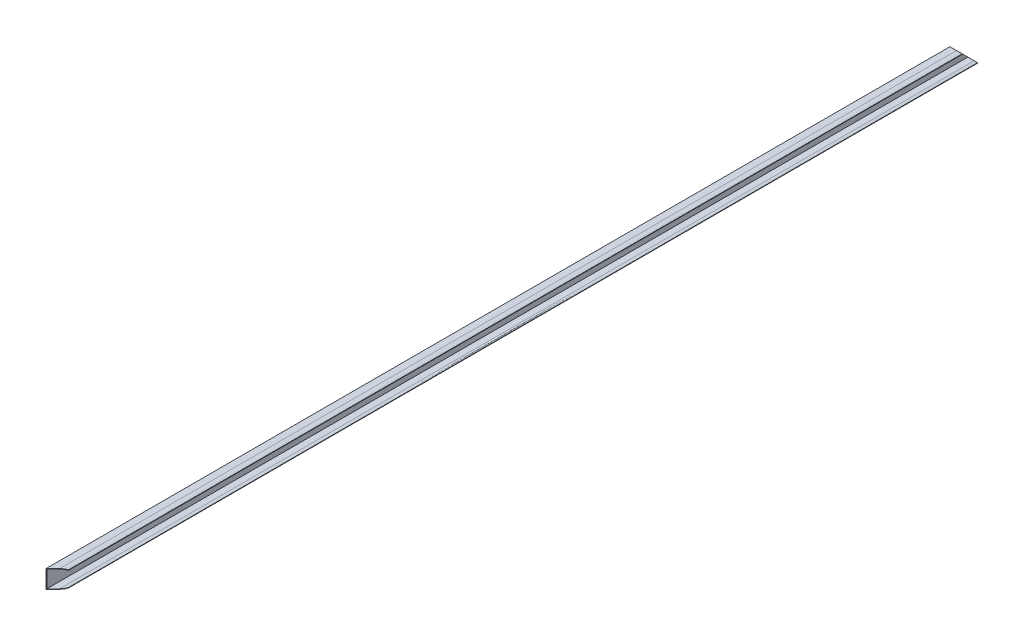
ISO-10303-21;
HEADER;
FILE_DESCRIPTION(('STEP AP214'),'2;1');
FILE_NAME('part.step','',(''),(''),'','','');
FILE_SCHEMA(('AUTOMOTIVE_DESIGN { 1 0 10303 214 1 1 1 1 }'));
ENDSEC;
DATA;
#1=APPLICATION_CONTEXT('core data for automotive mechanical design processes');
#2=APPLICATION_PROTOCOL_DEFINITION('international standard','automotive_design',2000,#1);
#3=PRODUCT_CONTEXT('',#1,'mechanical');
#4=PRODUCT('Part','Part','',(#3));
#5=PRODUCT_RELATED_PRODUCT_CATEGORY('part','',(#4));
#6=PRODUCT_DEFINITION_FORMATION('','',#4);
#7=PRODUCT_DEFINITION_CONTEXT('part definition',#1,'design');
#8=PRODUCT_DEFINITION('design','',#6,#7);
#9=PRODUCT_DEFINITION_SHAPE('','',#8);
#10=(LENGTH_UNIT() NAMED_UNIT(*) SI_UNIT(.MILLI.,.METRE.));
#11=(NAMED_UNIT(*) PLANE_ANGLE_UNIT() SI_UNIT($,.RADIAN.));
#12=(NAMED_UNIT(*) SI_UNIT($,.STERADIAN.) SOLID_ANGLE_UNIT());
#13=UNCERTAINTY_MEASURE_WITH_UNIT(LENGTH_MEASURE(1.E-05),#10,'distance_accuracy_value','');
#14=(GEOMETRIC_REPRESENTATION_CONTEXT(3) GLOBAL_UNCERTAINTY_ASSIGNED_CONTEXT((#13)) GLOBAL_UNIT_ASSIGNED_CONTEXT((#10,
#11,#12)) REPRESENTATION_CONTEXT('',''));
#15=CARTESIAN_POINT('',(0.,0.,0.));
#16=DIRECTION('',(0.,0.,1.));
#17=DIRECTION('',(1.,0.,0.));
#18=AXIS2_PLACEMENT_3D('',#15,#16,#17);
#19=CARTESIAN_POINT('',(0.,0.,4100.));
#20=DIRECTION('',(0.,1.,0.));
#21=DIRECTION('',(0.,0.,1.));
#22=AXIS2_PLACEMENT_3D('',#19,#20,#21);
#23=PLANE('',#22);
#24=DIRECTION('',(0.,0.,-1.));
#25=VECTOR('',#24,1.);
#26=CARTESIAN_POINT('',(30.,0.,4100.));
#27=LINE('',#26,#25);
#28=CARTESIAN_POINT('',(30.,0.,4070.));
#29=VERTEX_POINT('',#28);
#30=CARTESIAN_POINT('',(30.,0.,0.));
#31=VERTEX_POINT('',#30);
#32=EDGE_CURVE('E11',#29,#31,#27,.T.);
#33=ORIENTED_EDGE('',*,*,#32,.F.);
#34=DIRECTION('',(0.707106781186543,0.,-0.707106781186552));
#35=VECTOR('',#34,1.);
#36=CARTESIAN_POINT('',(0.,0.,4100.));
#37=LINE('',#36,#35);
#38=CARTESIAN_POINT('',(0.,0.,4100.));
#39=VERTEX_POINT('',#38);
#40=EDGE_CURVE('E194',#39,#29,#37,.T.);
#41=ORIENTED_EDGE('',*,*,#40,.F.);
#42=DIRECTION('',(0.,0.,-1.));
#43=VECTOR('',#42,1.);
#44=CARTESIAN_POINT('',(0.,0.,4100.));
#45=LINE('',#44,#43);
#46=CARTESIAN_POINT('',(0.,0.,0.));
#47=VERTEX_POINT('',#46);
#48=EDGE_CURVE('E371',#39,#47,#45,.T.);
#49=ORIENTED_EDGE('',*,*,#48,.T.);
#50=DIRECTION('',(1.,0.,0.));
#51=VECTOR('',#50,1.);
#52=CARTESIAN_POINT('',(0.,0.,0.));
#53=LINE('',#52,#51);
#54=EDGE_CURVE('E270',#47,#31,#53,.T.);
#55=ORIENTED_EDGE('',*,*,#54,.T.);
#56=EDGE_LOOP('',(#33,#41,#49,#55));
#57=FACE_BOUND('',#56,.T.);
#58=ADVANCED_FACE('F32',(#57),#23,.F.);
#59=CARTESIAN_POINT('',(30.,0.,4100.));
#60=CARTESIAN_POINT('',(40.6032812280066,0.0484567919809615,4100.));
#61=CARTESIAN_POINT('',(50.,5.,4100.));
#62=B_SPLINE_CURVE_WITH_KNOTS('',2,(#59,#60,#61),.UNSPECIFIED.,.F.,.F.,(3,3),(0.,1.),.UNSPECIFIED.);
#63=DIRECTION('',(0.,0.,-1.));
#64=VECTOR('',#63,1.);
#65=SURFACE_OF_LINEAR_EXTRUSION('',#62,#64);
#66=ORIENTED_EDGE('',*,*,#32,.T.);
#67=CARTESIAN_POINT('',(50.,5.,4.99999999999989));
#68=CARTESIAN_POINT('',(49.5210550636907,4.74761460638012,4.74761460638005));
#69=CARTESIAN_POINT('',(49.0347280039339,4.50214773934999,4.50214773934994));
#70=CARTESIAN_POINT('',(48.0467010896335,4.02606279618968,4.02606279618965));
#71=CARTESIAN_POINT('',(47.5449794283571,3.79546736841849,3.79546736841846));
#72=CARTESIAN_POINT('',(46.5267291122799,3.35078644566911,3.35078644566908));
#73=CARTESIAN_POINT('',(46.0101932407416,3.13670919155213,3.13670919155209));
#74=CARTESIAN_POINT('',(44.9634416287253,2.7267907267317,2.7267907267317));
#75=CARTESIAN_POINT('',(44.4332389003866,2.530932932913,2.53093293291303));
#76=CARTESIAN_POINT('',(43.3596325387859,2.1587101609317,2.15871016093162));
#77=CARTESIAN_POINT('',(42.8162357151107,1.9823353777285,1.98233537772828));
#78=CARTESIAN_POINT('',(41.7171702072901,1.65035131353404,1.65035131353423));
#79=CARTESIAN_POINT('',(41.1615076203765,1.49473197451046,1.49473197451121));
#80=CARTESIAN_POINT('',(40.1825845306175,1.2423713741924,1.24237137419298));
#81=CARTESIAN_POINT('',(39.7618260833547,1.14075340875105,1.1407534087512));
#82=CARTESIAN_POINT('',(38.9146879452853,0.950024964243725,0.950024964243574));
#83=CARTESIAN_POINT('',(38.4883085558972,0.860913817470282,0.860913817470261));
#84=CARTESIAN_POINT('',(37.6310401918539,0.695625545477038,0.695625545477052));
#85=CARTESIAN_POINT('',(37.2001563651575,0.619435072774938,0.619435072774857));
#86=CARTESIAN_POINT('',(36.3341748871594,0.480132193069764,0.480132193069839));
#87=CARTESIAN_POINT('',(35.8990771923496,0.41701992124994,0.417019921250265));
#88=CARTESIAN_POINT('',(35.0123765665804,0.302350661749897,0.302350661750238));
#89=CARTESIAN_POINT('',(34.5606694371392,0.251196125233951,0.251196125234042));
#90=CARTESIAN_POINT('',(33.6544975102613,0.16301119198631,0.16301119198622));
#91=CARTESIAN_POINT('',(33.2000326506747,0.125981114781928,0.125981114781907));
#92=CARTESIAN_POINT('',(32.2884626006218,0.0659644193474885,0.0659644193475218));
#93=CARTESIAN_POINT('',(31.831354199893,0.0430022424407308,0.0430022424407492));
#94=CARTESIAN_POINT('',(30.9161801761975,0.0110581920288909,0.0110581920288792));
#95=CARTESIAN_POINT('',(30.4581145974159,0.00207568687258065,0.00207568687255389));
#96=CARTESIAN_POINT('',(30.,0.,0.));
#97=B_SPLINE_CURVE_WITH_KNOTS('',3,(#67,#68,#69,#70,#71,#72,#73,#74,#75,#76,#77,#78,#79,#80,#81,
#82,#83,#84,#85,#86,#87,#88,#89,#90,#91,#92,#93,#94,#95,#96),.UNSPECIFIED.,.F.,.F.,(4,2,2,2,2,2,
2,2,2,2,2,2,2,2,4),(0.,1.79192712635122,3.58652177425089,5.38200602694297,7.17583972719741,
8.96876650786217,10.7608212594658,12.0943329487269,13.4277734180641,14.759827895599,
16.0918961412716,17.4638388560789,18.8358126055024,20.2101632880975,21.5844518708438),.UNSPECIFIED.);
#98=CARTESIAN_POINT('',(50.,4.99999999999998,4.99999999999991));
#99=VERTEX_POINT('',#98);
#100=EDGE_CURVE('E305',#99,#31,#97,.T.);
#101=ORIENTED_EDGE('',*,*,#100,.F.);
#102=DIRECTION('',(0.,0.,-1.));
#103=VECTOR('',#102,1.);
#104=CARTESIAN_POINT('',(50.,5.,4100.));
#105=LINE('',#104,#103);
#106=CARTESIAN_POINT('',(50.,5.,4050.));
#107=VERTEX_POINT('',#106);
#108=EDGE_CURVE('E46',#107,#99,#105,.T.);
#109=ORIENTED_EDGE('',*,*,#108,.F.);
#110=CARTESIAN_POINT('',(30.,0.,4070.));
#111=CARTESIAN_POINT('',(30.6272946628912,0.00285611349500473,4069.37270533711));
#112=CARTESIAN_POINT('',(31.2545746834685,0.0186179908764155,4068.74542531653));
#113=CARTESIAN_POINT('',(32.5085722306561,0.076653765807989,4067.49142776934));
#114=CARTESIAN_POINT('',(33.1352897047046,0.118929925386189,4066.8647102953));
#115=CARTESIAN_POINT('',(34.3876637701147,0.230707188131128,4065.61233622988));
#116=CARTESIAN_POINT('',(35.0133200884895,0.300214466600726,4064.98667991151));
#117=CARTESIAN_POINT('',(36.2627376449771,0.467046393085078,4063.73726235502));
#118=CARTESIAN_POINT('',(36.8864989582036,0.564369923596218,4063.1135010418));
#119=CARTESIAN_POINT('',(38.5675300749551,0.865472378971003,4061.43246992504));
#120=CARTESIAN_POINT('',(39.6224623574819,1.09607135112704,4060.37753764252));
#121=CARTESIAN_POINT('',(41.7212568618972,1.64106978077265,4058.2787431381));
#122=CARTESIAN_POINT('',(42.7651214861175,1.9554506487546,4057.23487851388));
#123=CARTESIAN_POINT('',(44.326772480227,2.49275963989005,4055.67322751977));
#124=CARTESIAN_POINT('',(44.8500436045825,2.68429385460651,4055.14995639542));
#125=CARTESIAN_POINT('',(45.8923921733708,3.08904722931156,4054.10760782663));
#126=CARTESIAN_POINT('',(46.4114696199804,3.30226637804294,4053.58853038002));
#127=CARTESIAN_POINT('',(47.4451599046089,3.75040246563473,4052.55484009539));
#128=CARTESIAN_POINT('',(47.9597707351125,3.98532865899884,4052.04022926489));
#129=CARTESIAN_POINT('',(48.9838539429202,4.47662567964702,4051.01614605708));
#130=CARTESIAN_POINT('',(49.4933262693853,4.73299671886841,4050.50667373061));
#131=CARTESIAN_POINT('',(50.,5.,4050.));
#132=B_SPLINE_CURVE_WITH_KNOTS('',3,(#110,#111,#112,#113,#114,#115,#116,#117,#118,#119,#120,
#121,#122,#123,#124,#125,#126,#127,#128,#129,#130,#131),.UNSPECIFIED.,.F.,.F.,(4,2,2,2,2,2,2,2,
2,2,4),(0.,2.66133520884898,5.32289749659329,7.9850637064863,10.6471229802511,15.1735338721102,
19.6989412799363,21.9918706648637,24.2847988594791,26.5787091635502,28.8726421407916),.UNSPECIFIED.);
#133=EDGE_CURVE('E184',#29,#107,#132,.T.);
#134=ORIENTED_EDGE('',*,*,#133,.F.);
#135=EDGE_LOOP('',(#66,#101,#109,#134));
#136=FACE_BOUND('',#135,.T.);
#137=ADVANCED_FACE('F419',(#136),#65,.F.);
#138=CARTESIAN_POINT('',(50.,5.,4100.));
#139=DIRECTION('',(-1.,0.,0.));
#140=DIRECTION('',(0.,0.,1.));
#141=AXIS2_PLACEMENT_3D('',#138,#139,#140);
#142=PLANE('',#141);
#143=ORIENTED_EDGE('',*,*,#108,.T.);
#144=DIRECTION('',(0.,-0.707106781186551,-0.707106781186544));
#145=VECTOR('',#144,1.);
#146=CARTESIAN_POINT('',(50.,80.,79.9999999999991));
#147=LINE('',#146,#145);
#148=CARTESIAN_POINT('',(50.,7.00000000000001,6.99999999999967));
#149=VERTEX_POINT('',#148);
#150=EDGE_CURVE('E292',#149,#99,#147,.T.);
#151=ORIENTED_EDGE('',*,*,#150,.F.);
#152=DIRECTION('',(0.,0.,-1.));
#153=VECTOR('',#152,1.);
#154=CARTESIAN_POINT('',(50.,7.00000000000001,4100.));
#155=LINE('',#154,#153);
#156=CARTESIAN_POINT('',(50.,7.00000000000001,4050.));
#157=VERTEX_POINT('',#156);
#158=EDGE_CURVE('E173',#157,#149,#155,.T.);
#159=ORIENTED_EDGE('',*,*,#158,.F.);
#160=DIRECTION('',(0.,1.,0.));
#161=VECTOR('',#160,1.);
#162=CARTESIAN_POINT('',(50.,-0.001000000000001,4050.));
#163=LINE('',#162,#161);
#164=EDGE_CURVE('E247',#107,#157,#163,.T.);
#165=ORIENTED_EDGE('',*,*,#164,.F.);
#166=EDGE_LOOP('',(#143,#151,#159,#165));
#167=FACE_BOUND('',#166,.T.);
#168=ADVANCED_FACE('F405',(#167),#142,.F.);
#169=CARTESIAN_POINT('',(50.,7.00000000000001,4100.));
#170=CARTESIAN_POINT('',(40.6032812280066,2.04845679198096,4100.));
#171=CARTESIAN_POINT('',(30.,2.,4100.));
#172=B_SPLINE_CURVE_WITH_KNOTS('',2,(#169,#170,#171),.UNSPECIFIED.,.F.,.F.,(3,3),(0.,1.),.UNSPECIFIED.);
#173=DIRECTION('',(0.,0.,-1.));
#174=VECTOR('',#173,1.);
#175=SURFACE_OF_LINEAR_EXTRUSION('',#172,#174);
#176=ORIENTED_EDGE('',*,*,#158,.T.);
#177=CARTESIAN_POINT('',(30.,2.,1.99999999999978));
#178=CARTESIAN_POINT('',(30.2965221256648,2.00135208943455,2.00135208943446));
#179=CARTESIAN_POINT('',(30.5930205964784,2.00558904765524,2.00558904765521));
#180=CARTESIAN_POINT('',(31.1856963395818,2.01988890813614,2.01988890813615));
#181=CARTESIAN_POINT('',(31.4818736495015,2.02995103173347,2.02995103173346));
#182=CARTESIAN_POINT('',(32.0736889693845,2.05595672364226,2.05595672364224));
#183=CARTESIAN_POINT('',(32.3693270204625,2.07189982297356,2.07189982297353));
#184=CARTESIAN_POINT('',(32.9597359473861,2.10969490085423,2.10969490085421));
#185=CARTESIAN_POINT('',(33.2545071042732,2.13154468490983,2.13154468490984));
#186=CARTESIAN_POINT('',(33.8430758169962,2.18117540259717,2.1811754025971));
#187=CARTESIAN_POINT('',(34.1368732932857,2.20895680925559,2.2089568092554));
#188=CARTESIAN_POINT('',(34.7232698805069,2.27044981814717,2.27044981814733));
#189=CARTESIAN_POINT('',(35.0158687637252,2.30416249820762,2.30416249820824));
#190=CARTESIAN_POINT('',(35.8889009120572,2.41384806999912,2.41384807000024));
#191=CARTESIAN_POINT('',(36.467182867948,2.49858893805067,2.49858893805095));
#192=CARTESIAN_POINT('',(37.6162181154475,2.69114757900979,2.69114757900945));
#193=CARTESIAN_POINT('',(38.1869682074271,2.79897484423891,2.79897484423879));
#194=CARTESIAN_POINT('',(39.3191210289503,3.0370161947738,3.03701619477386));
#195=CARTESIAN_POINT('',(39.8805226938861,3.16723281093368,3.16723281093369));
#196=CARTESIAN_POINT('',(40.9934871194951,3.44938335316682,3.44938335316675));
#197=CARTESIAN_POINT('',(41.5450291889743,3.60135801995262,3.60135801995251));
#198=CARTESIAN_POINT('',(42.6358830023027,3.92568946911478,3.92568946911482));
#199=CARTESIAN_POINT('',(43.1751963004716,4.09804364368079,4.09804364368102));
#200=CARTESIAN_POINT('',(44.2406108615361,4.46185600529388,4.46185600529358));
#201=CARTESIAN_POINT('',(44.7667154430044,4.65330933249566,4.65330933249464));
#202=CARTESIAN_POINT('',(45.5602041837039,4.95948974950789,4.95948974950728));
#203=CARTESIAN_POINT('',(45.8325761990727,5.06781364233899,5.06781364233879));
#204=CARTESIAN_POINT('',(46.3733730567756,5.28921123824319,5.28921123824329));
#205=CARTESIAN_POINT('',(46.6417986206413,5.40228405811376,5.40228405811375));
#206=CARTESIAN_POINT('',(47.1746722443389,5.63298659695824,5.63298659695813));
#207=CARTESIAN_POINT('',(47.4391205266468,5.75061605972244,5.75061605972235));
#208=CARTESIAN_POINT('',(48.4854647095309,6.22828118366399,6.22828118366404));
#209=CARTESIAN_POINT('',(49.2516390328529,6.60563986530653,6.60563986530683));
#210=CARTESIAN_POINT('',(50.,7.00000000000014,6.99999999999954));
#211=B_SPLINE_CURVE_WITH_KNOTS('',3,(#177,#178,#179,#180,#181,#182,#183,#184,#185,#186,#187,
#188,#189,#190,#191,#192,#193,#194,#195,#196,#197,#198,#199,#200,#201,#202,#203,#204,#205,#206,
#207,#208,#209,#210),.UNSPECIFIED.,.F.,.F.,(4,2,2,2,2,2,2,2,2,2,2,2,2,2,2,2,4),(0.,
0.889560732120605,1.77900258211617,2.66837351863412,3.55741448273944,4.44652637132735,
5.33579999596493,7.10646365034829,8.87785674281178,10.6494502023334,12.4244053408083,
14.1991335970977,15.9734114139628,16.9108234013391,17.8480618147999,18.785247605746,
21.5842762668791),.UNSPECIFIED.);
#212=CARTESIAN_POINT('',(30.,2.,1.99999999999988));
#213=VERTEX_POINT('',#212);
#214=EDGE_CURVE('E290',#213,#149,#211,.T.);
#215=ORIENTED_EDGE('',*,*,#214,.F.);
#216=DIRECTION('',(0.,0.,-1.));
#217=VECTOR('',#216,1.);
#218=CARTESIAN_POINT('',(30.,2.,4100.));
#219=LINE('',#218,#217);
#220=CARTESIAN_POINT('',(30.,2.,4070.));
#221=VERTEX_POINT('',#220);
#222=EDGE_CURVE('E169',#221,#213,#219,.T.);
#223=ORIENTED_EDGE('',*,*,#222,.F.);
#224=CARTESIAN_POINT('',(50.,7.,4050.));
#225=CARTESIAN_POINT('',(49.4114796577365,6.68985586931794,4050.58852034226));
#226=CARTESIAN_POINT('',(48.8191807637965,6.39406911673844,4051.1808192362));
#227=CARTESIAN_POINT('',(47.6277425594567,5.83146471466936,4052.37225744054));
#228=CARTESIAN_POINT('',(47.0286032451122,5.56464708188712,4052.97139675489));
#229=CARTESIAN_POINT('',(45.8245910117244,5.06039872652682,4054.17540898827));
#230=CARTESIAN_POINT('',(45.2197220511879,4.82294911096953,4054.78027794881));
#231=CARTESIAN_POINT('',(44.0046502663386,4.37731903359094,4055.99534973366));
#232=CARTESIAN_POINT('',(43.3944475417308,4.16913802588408,4056.60555245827));
#233=CARTESIAN_POINT('',(41.740562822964,3.64647116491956,4058.25943717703));
#234=CARTESIAN_POINT('',(40.6924545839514,3.35958497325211,4059.30754541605));
#235=CARTESIAN_POINT('',(38.5864777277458,2.86914994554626,4061.41352227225));
#236=CARTESIAN_POINT('',(37.5286076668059,2.66561364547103,4062.47139233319));
#237=CARTESIAN_POINT('',(35.3936831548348,2.33778410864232,4064.60631684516));
#238=CARTESIAN_POINT('',(34.3165519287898,2.2144856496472,4065.68344807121));
#239=CARTESIAN_POINT('',(32.6988221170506,2.08966723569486,4067.30117788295));
#240=CARTESIAN_POINT('',(32.1592904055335,2.05808278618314,4067.84070959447));
#241=CARTESIAN_POINT('',(31.0798528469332,2.01448260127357,4068.92014715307));
#242=CARTESIAN_POINT('',(30.5399470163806,2.00246605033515,4069.46005298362));
#243=CARTESIAN_POINT('',(30.0000000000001,2.,4070.));
#244=B_SPLINE_CURVE_WITH_KNOTS('',3,(#224,#225,#226,#227,#228,#229,#230,#231,#232,#233,#234,
#235,#236,#237,#238,#239,#240,#241,#242,#243),.UNSPECIFIED.,.F.,.F.,(4,2,2,2,2,2,2,2,2,4),(0.,
2.66446206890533,5.32892567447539,7.99166616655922,10.6543569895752,15.1809940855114,
19.7083117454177,24.2907399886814,26.5815270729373,28.8722186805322),.UNSPECIFIED.);
#245=EDGE_CURVE('E186',#157,#221,#244,.T.);
#246=ORIENTED_EDGE('',*,*,#245,.F.);
#247=EDGE_LOOP('',(#176,#215,#223,#246));
#248=FACE_BOUND('',#247,.T.);
#249=ADVANCED_FACE('F402',(#248),#175,.F.);
#250=CARTESIAN_POINT('',(2.,2.,4100.));
#251=DIRECTION('',(0.,-1.,0.));
#252=DIRECTION('',(0.,0.,-1.));
#253=AXIS2_PLACEMENT_3D('',#250,#251,#252);
#254=PLANE('',#253);
#255=ORIENTED_EDGE('',*,*,#222,.T.);
#256=DIRECTION('',(1.,0.,0.));
#257=VECTOR('',#256,1.);
#258=CARTESIAN_POINT('',(50.00105,2.,1.99999999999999));
#259=LINE('',#258,#257);
#260=CARTESIAN_POINT('',(2.,2.,1.99999999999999));
#261=VERTEX_POINT('',#260);
#262=EDGE_CURVE('E288',#261,#213,#259,.T.);
#263=ORIENTED_EDGE('',*,*,#262,.F.);
#264=DIRECTION('',(0.,0.,-1.));
#265=VECTOR('',#264,1.);
#266=CARTESIAN_POINT('',(2.,2.,4100.));
#267=LINE('',#266,#265);
#268=CARTESIAN_POINT('',(2.,2.,4098.));
#269=VERTEX_POINT('',#268);
#270=EDGE_CURVE('E174',#269,#261,#267,.T.);
#271=ORIENTED_EDGE('',*,*,#270,.F.);
#272=DIRECTION('',(-0.707106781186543,0.,0.707106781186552));
#273=VECTOR('',#272,1.);
#274=CARTESIAN_POINT('',(0.,2.,4100.));
#275=LINE('',#274,#273);
#276=EDGE_CURVE('E266',#221,#269,#275,.T.);
#277=ORIENTED_EDGE('',*,*,#276,.F.);
#278=EDGE_LOOP('',(#255,#263,#271,#277));
#279=FACE_BOUND('',#278,.T.);
#280=ADVANCED_FACE('F286',(#279),#254,.F.);
#281=CARTESIAN_POINT('',(2.,78.,4100.));
#282=DIRECTION('',(-1.,0.,0.));
#283=DIRECTION('',(0.,0.,1.));
#284=AXIS2_PLACEMENT_3D('',#281,#282,#283);
#285=PLANE('',#284);
#286=ORIENTED_EDGE('',*,*,#270,.T.);
#287=DIRECTION('',(0.,-0.707106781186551,-0.707106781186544));
#288=VECTOR('',#287,1.);
#289=CARTESIAN_POINT('',(2.,80.,79.9999999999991));
#290=LINE('',#289,#288);
#291=CARTESIAN_POINT('',(2.,78.,77.9999999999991));
#292=VERTEX_POINT('',#291);
#293=EDGE_CURVE('E209',#292,#261,#290,.T.);
#294=ORIENTED_EDGE('',*,*,#293,.F.);
#295=DIRECTION('',(0.,0.,-1.));
#296=VECTOR('',#295,1.);
#297=CARTESIAN_POINT('',(2.,78.,4100.));
#298=LINE('',#297,#296);
#299=CARTESIAN_POINT('',(2.,78.,4098.));
#300=VERTEX_POINT('',#299);
#301=EDGE_CURVE('E165',#300,#292,#298,.T.);
#302=ORIENTED_EDGE('',*,*,#301,.F.);
#303=DIRECTION('',(0.,1.,0.));
#304=VECTOR('',#303,1.);
#305=CARTESIAN_POINT('',(2.,-0.001000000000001,4098.));
#306=LINE('',#305,#304);
#307=EDGE_CURVE('E246',#269,#300,#306,.T.);
#308=ORIENTED_EDGE('',*,*,#307,.F.);
#309=EDGE_LOOP('',(#286,#294,#302,#308));
#310=FACE_BOUND('',#309,.T.);
#311=ADVANCED_FACE('F283',(#310),#285,.F.);
#312=CARTESIAN_POINT('',(2.,78.,4100.));
#313=DIRECTION('',(0.,1.,0.));
#314=DIRECTION('',(0.,0.,1.));
#315=AXIS2_PLACEMENT_3D('',#312,#313,#314);
#316=PLANE('',#315);
#317=ORIENTED_EDGE('',*,*,#301,.T.);
#318=DIRECTION('',(-1.,0.,0.));
#319=VECTOR('',#318,1.);
#320=CARTESIAN_POINT('',(50.00105,78.,77.9999999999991));
#321=LINE('',#320,#319);
#322=CARTESIAN_POINT('',(30.,78.,77.9999999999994));
#323=VERTEX_POINT('',#322);
#324=EDGE_CURVE('E294',#323,#292,#321,.T.);
#325=ORIENTED_EDGE('',*,*,#324,.F.);
#326=DIRECTION('',(0.,0.,-1.));
#327=VECTOR('',#326,1.);
#328=CARTESIAN_POINT('',(30.,78.,4100.));
#329=LINE('',#328,#327);
#330=CARTESIAN_POINT('',(30.,78.,4070.));
#331=VERTEX_POINT('',#330);
#332=EDGE_CURVE('E149',#331,#323,#329,.T.);
#333=ORIENTED_EDGE('',*,*,#332,.F.);
#334=DIRECTION('',(0.707106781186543,0.,-0.707106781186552));
#335=VECTOR('',#334,1.);
#336=CARTESIAN_POINT('',(0.,78.,4100.));
#337=LINE('',#336,#335);
#338=EDGE_CURVE('E244',#300,#331,#337,.T.);
#339=ORIENTED_EDGE('',*,*,#338,.F.);
#340=EDGE_LOOP('',(#317,#325,#333,#339));
#341=FACE_BOUND('',#340,.T.);
#342=ADVANCED_FACE('F280',(#341),#316,.F.);
#343=CARTESIAN_POINT('',(30.,78.,4100.));
#344=CARTESIAN_POINT('',(40.6032812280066,77.951543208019,4100.));
#345=CARTESIAN_POINT('',(50.,73.,4100.));
#346=B_SPLINE_CURVE_WITH_KNOTS('',2,(#343,#344,#345),.UNSPECIFIED.,.F.,.F.,(3,3),(0.,1.),.UNSPECIFIED.);
#347=DIRECTION('',(0.,0.,-1.));
#348=VECTOR('',#347,1.);
#349=SURFACE_OF_LINEAR_EXTRUSION('',#346,#348);
#350=ORIENTED_EDGE('',*,*,#332,.T.);
#351=CARTESIAN_POINT('',(50.,73.,72.9999999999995));
#352=CARTESIAN_POINT('',(49.5210550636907,73.2523853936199,73.2523853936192));
#353=CARTESIAN_POINT('',(49.0347280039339,73.49785226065,73.4978522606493));
#354=CARTESIAN_POINT('',(48.0467010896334,73.9739372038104,73.9739372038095));
#355=CARTESIAN_POINT('',(47.544979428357,74.2045326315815,74.2045326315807));
#356=CARTESIAN_POINT('',(46.5267291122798,74.6492135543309,74.6492135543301));
#357=CARTESIAN_POINT('',(46.0101932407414,74.8632908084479,74.8632908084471));
#358=CARTESIAN_POINT('',(44.9634416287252,75.2732092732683,75.2732092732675));
#359=CARTESIAN_POINT('',(44.4332389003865,75.469067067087,75.4690670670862));
#360=CARTESIAN_POINT('',(43.3596325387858,75.8412898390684,75.8412898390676));
#361=CARTESIAN_POINT('',(42.8162357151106,76.0176646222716,76.0176646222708));
#362=CARTESIAN_POINT('',(41.71717020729,76.349648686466,76.3496486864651));
#363=CARTESIAN_POINT('',(41.1615076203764,76.5052680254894,76.5052680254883));
#364=CARTESIAN_POINT('',(40.1825845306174,76.7576286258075,76.7576286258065));
#365=CARTESIAN_POINT('',(39.7618260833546,76.859246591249,76.8592465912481));
#366=CARTESIAN_POINT('',(38.9146879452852,77.0499750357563,77.0499750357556));
#367=CARTESIAN_POINT('',(38.488308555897,77.1390861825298,77.1390861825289));
#368=CARTESIAN_POINT('',(37.6310401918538,77.304374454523,77.3043744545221));
#369=CARTESIAN_POINT('',(37.2001563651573,77.3805649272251,77.3805649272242));
#370=CARTESIAN_POINT('',(36.3341748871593,77.5198678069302,77.5198678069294));
#371=CARTESIAN_POINT('',(35.8990771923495,77.58298007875,77.5829800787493));
#372=CARTESIAN_POINT('',(35.0123765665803,77.69764933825,77.6976493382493));
#373=CARTESIAN_POINT('',(34.5606694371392,77.748803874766,77.7488038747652));
#374=CARTESIAN_POINT('',(33.6544975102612,77.8369888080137,77.8369888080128));
#375=CARTESIAN_POINT('',(33.2000326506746,77.8740188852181,77.8740188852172));
#376=CARTESIAN_POINT('',(32.2884626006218,77.9340355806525,77.9340355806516));
#377=CARTESIAN_POINT('',(31.831354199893,77.9569977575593,77.9569977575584));
#378=CARTESIAN_POINT('',(30.9161801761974,77.9889418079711,77.9889418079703));
#379=CARTESIAN_POINT('',(30.4581145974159,77.9979243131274,77.9979243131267));
#380=CARTESIAN_POINT('',(30.,77.9999999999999,77.9999999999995));
#381=B_SPLINE_CURVE_WITH_KNOTS('',3,(#351,#352,#353,#354,#355,#356,#357,#358,#359,#360,#361,
#362,#363,#364,#365,#366,#367,#368,#369,#370,#371,#372,#373,#374,#375,#376,#377,#378,#379,#380),
.UNSPECIFIED.,.F.,.F.,(4,2,2,2,2,2,2,2,2,2,2,2,2,2,4),(0.,1.79192712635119,3.58652177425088,
5.38200602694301,7.17583972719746,8.96876650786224,10.7608212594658,12.094332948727,
13.4277734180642,14.759827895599,16.0918961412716,17.4638388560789,18.8358126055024,
20.2101632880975,21.5844518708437),.UNSPECIFIED.);
#382=CARTESIAN_POINT('',(50.,73.0000000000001,72.9999999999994));
#383=VERTEX_POINT('',#382);
#384=EDGE_CURVE('E142',#383,#323,#381,.T.);
#385=ORIENTED_EDGE('',*,*,#384,.F.);
#386=DIRECTION('',(0.,0.,-1.));
#387=VECTOR('',#386,1.);
#388=CARTESIAN_POINT('',(50.,73.,4100.));
#389=LINE('',#388,#387);
#390=CARTESIAN_POINT('',(50.,73.,4050.));
#391=VERTEX_POINT('',#390);
#392=EDGE_CURVE('E141',#391,#383,#389,.T.);
#393=ORIENTED_EDGE('',*,*,#392,.F.);
#394=CARTESIAN_POINT('',(30.,78.,4070.));
#395=CARTESIAN_POINT('',(30.6272946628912,77.997143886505,4069.37270533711));
#396=CARTESIAN_POINT('',(31.2545746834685,77.9813820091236,4068.74542531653));
#397=CARTESIAN_POINT('',(32.5085722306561,77.923346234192,4067.49142776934));
#398=CARTESIAN_POINT('',(33.1352897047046,77.8810700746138,4066.8647102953));
#399=CARTESIAN_POINT('',(34.3876637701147,77.7692928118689,4065.61233622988));
#400=CARTESIAN_POINT('',(35.0133200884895,77.6997855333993,4064.98667991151));
#401=CARTESIAN_POINT('',(36.2627376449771,77.5329536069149,4063.73726235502));
#402=CARTESIAN_POINT('',(36.8864989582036,77.4356300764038,4063.1135010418));
#403=CARTESIAN_POINT('',(38.5675300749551,77.134527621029,4061.43246992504));
#404=CARTESIAN_POINT('',(39.6224623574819,76.9039286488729,4060.37753764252));
#405=CARTESIAN_POINT('',(41.7212568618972,76.3589302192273,4058.2787431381));
#406=CARTESIAN_POINT('',(42.7651214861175,76.0445493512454,4057.23487851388));
#407=CARTESIAN_POINT('',(44.326772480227,75.5072403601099,4055.67322751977));
#408=CARTESIAN_POINT('',(44.8500436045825,75.3157061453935,4055.14995639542));
#409=CARTESIAN_POINT('',(45.8923921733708,74.9109527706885,4054.10760782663));
#410=CARTESIAN_POINT('',(46.4114696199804,74.6977336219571,4053.58853038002));
#411=CARTESIAN_POINT('',(47.4451599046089,74.2495975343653,4052.55484009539));
#412=CARTESIAN_POINT('',(47.9597707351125,74.0146713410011,4052.04022926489));
#413=CARTESIAN_POINT('',(48.9838539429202,73.523374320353,4051.01614605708));
#414=CARTESIAN_POINT('',(49.4933262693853,73.2670032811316,4050.50667373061));
#415=CARTESIAN_POINT('',(50.,73.,4050.));
#416=B_SPLINE_CURVE_WITH_KNOTS('',3,(#394,#395,#396,#397,#398,#399,#400,#401,#402,#403,#404,
#405,#406,#407,#408,#409,#410,#411,#412,#413,#414,#415),.UNSPECIFIED.,.F.,.F.,(4,2,2,2,2,2,2,2,
2,2,4),(0.,2.66133520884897,5.32289749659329,7.98506370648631,10.6471229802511,15.1735338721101,
19.6989412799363,21.9918706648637,24.2847988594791,26.5787091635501,28.8726421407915),.UNSPECIFIED.);
#417=EDGE_CURVE('E242',#331,#391,#416,.T.);
#418=ORIENTED_EDGE('',*,*,#417,.F.);
#419=EDGE_LOOP('',(#350,#385,#393,#418));
#420=FACE_BOUND('',#419,.T.);
#421=ADVANCED_FACE('F309',(#420),#349,.F.);
#422=CARTESIAN_POINT('',(50.,75.,4100.));
#423=DIRECTION('',(-1.,0.,0.));
#424=DIRECTION('',(0.,0.,1.));
#425=AXIS2_PLACEMENT_3D('',#422,#423,#424);
#426=PLANE('',#425);
#427=ORIENTED_EDGE('',*,*,#392,.T.);
#428=DIRECTION('',(0.,-0.707106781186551,-0.707106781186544));
#429=VECTOR('',#428,1.);
#430=CARTESIAN_POINT('',(50.,80.,79.9999999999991));
#431=LINE('',#430,#429);
#432=CARTESIAN_POINT('',(50.,75.,74.9999999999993));
#433=VERTEX_POINT('',#432);
#434=EDGE_CURVE('E125',#433,#383,#431,.T.);
#435=ORIENTED_EDGE('',*,*,#434,.F.);
#436=DIRECTION('',(0.,0.,-1.));
#437=VECTOR('',#436,1.);
#438=CARTESIAN_POINT('',(50.,75.,4100.));
#439=LINE('',#438,#437);
#440=CARTESIAN_POINT('',(50.,75.,4050.));
#441=VERTEX_POINT('',#440);
#442=EDGE_CURVE('E139',#441,#433,#439,.T.);
#443=ORIENTED_EDGE('',*,*,#442,.F.);
#444=EDGE_CURVE('E250',#391,#441,#163,.T.);
#445=ORIENTED_EDGE('',*,*,#444,.F.);
#446=EDGE_LOOP('',(#427,#435,#443,#445));
#447=FACE_BOUND('',#446,.T.);
#448=ADVANCED_FACE('F137',(#447),#426,.F.);
#449=CARTESIAN_POINT('',(50.,75.,4100.));
#450=CARTESIAN_POINT('',(40.6032812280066,79.951543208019,4100.));
#451=CARTESIAN_POINT('',(30.,80.,4100.));
#452=B_SPLINE_CURVE_WITH_KNOTS('',2,(#449,#450,#451),.UNSPECIFIED.,.F.,.F.,(3,3),(0.,1.),.UNSPECIFIED.);
#453=DIRECTION('',(0.,0.,-1.));
#454=VECTOR('',#453,1.);
#455=SURFACE_OF_LINEAR_EXTRUSION('',#452,#454);
#456=ORIENTED_EDGE('',*,*,#442,.T.);
#457=CARTESIAN_POINT('',(30.0000000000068,80.,79.9999999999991));
#458=CARTESIAN_POINT('',(30.2965221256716,79.9986479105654,79.9986479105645));
#459=CARTESIAN_POINT('',(30.5930205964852,79.9944109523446,79.9944109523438));
#460=CARTESIAN_POINT('',(31.1856963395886,79.9801110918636,79.9801110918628));
#461=CARTESIAN_POINT('',(31.4818736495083,79.9700489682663,79.9700489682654));
#462=CARTESIAN_POINT('',(32.0736889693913,79.9440432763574,79.9440432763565));
#463=CARTESIAN_POINT('',(32.3693270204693,79.9281001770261,79.9281001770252));
#464=CARTESIAN_POINT('',(32.9597359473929,79.8903050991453,79.8903050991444));
#465=CARTESIAN_POINT('',(33.25450710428,79.8684553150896,79.8684553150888));
#466=CARTESIAN_POINT('',(33.8430758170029,79.8188245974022,79.8188245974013));
#467=CARTESIAN_POINT('',(34.1368732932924,79.7910431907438,79.7910431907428));
#468=CARTESIAN_POINT('',(34.7232698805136,79.729550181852,79.7295501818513));
#469=CARTESIAN_POINT('',(35.015868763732,79.6958375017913,79.6958375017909));
#470=CARTESIAN_POINT('',(35.888900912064,79.5861519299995,79.5861519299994));
#471=CARTESIAN_POINT('',(36.4671828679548,79.5014110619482,79.5014110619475));
#472=CARTESIAN_POINT('',(37.6162181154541,79.3088524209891,79.308852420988));
#473=CARTESIAN_POINT('',(38.1869682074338,79.2010251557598,79.2010251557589));
#474=CARTESIAN_POINT('',(39.3191210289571,78.9629838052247,78.9629838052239));
#475=CARTESIAN_POINT('',(39.8805226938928,78.8327671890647,78.8327671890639));
#476=CARTESIAN_POINT('',(40.9934871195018,78.5506166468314,78.5506166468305));
#477=CARTESIAN_POINT('',(41.545029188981,78.3986419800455,78.3986419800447));
#478=CARTESIAN_POINT('',(42.6358830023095,78.0743105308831,78.0743105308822));
#479=CARTESIAN_POINT('',(43.1751963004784,77.901956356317,77.901956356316));
#480=CARTESIAN_POINT('',(44.2406108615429,77.5381439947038,77.538143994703));
#481=CARTESIAN_POINT('',(44.766715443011,77.346690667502,77.3466906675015));
#482=CARTESIAN_POINT('',(45.5602041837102,77.0405102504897,77.0405102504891));
#483=CARTESIAN_POINT('',(45.8325761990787,76.9321863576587,76.9321863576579));
#484=CARTESIAN_POINT('',(46.3733730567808,76.7107887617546,76.7107887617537));
#485=CARTESIAN_POINT('',(46.6417986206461,76.5977159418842,76.5977159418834));
#486=CARTESIAN_POINT('',(47.1746722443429,76.36701340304,76.3670134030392));
#487=CARTESIAN_POINT('',(47.4391205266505,76.2493839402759,76.2493839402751));
#488=CARTESIAN_POINT('',(48.485464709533,75.7717188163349,75.7717188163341));
#489=CARTESIAN_POINT('',(49.251639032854,75.3943601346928,75.3943601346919));
#490=CARTESIAN_POINT('',(50.,74.9999999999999,74.9999999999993));
#491=B_SPLINE_CURVE_WITH_KNOTS('',3,(#457,#458,#459,#460,#461,#462,#463,#464,#465,#466,#467,
#468,#469,#470,#471,#472,#473,#474,#475,#476,#477,#478,#479,#480,#481,#482,#483,#484,#485,#486,
#487,#488,#489,#490),.UNSPECIFIED.,.F.,.F.,(4,2,2,2,2,2,2,2,2,2,2,2,2,2,2,2,4),(0.,
0.88956073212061,1.77900258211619,2.66837351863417,3.55741448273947,4.44652637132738,
5.33579999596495,7.10646365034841,8.87785674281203,10.6494502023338,12.4244053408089,
14.1991335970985,15.9734114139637,16.9108234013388,17.8480618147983,18.7852476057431,
21.5842762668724),.UNSPECIFIED.);
#492=CARTESIAN_POINT('',(30.,80.,79.9999999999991));
#493=VERTEX_POINT('',#492);
#494=EDGE_CURVE('E122',#493,#433,#491,.T.);
#495=ORIENTED_EDGE('',*,*,#494,.F.);
#496=DIRECTION('',(0.,0.,-1.));
#497=VECTOR('',#496,1.);
#498=CARTESIAN_POINT('',(30.,80.,4100.));
#499=LINE('',#498,#497);
#500=CARTESIAN_POINT('',(30.,80.,4070.));
#501=VERTEX_POINT('',#500);
#502=EDGE_CURVE('E147',#501,#493,#499,.T.);
#503=ORIENTED_EDGE('',*,*,#502,.F.);
#504=CARTESIAN_POINT('',(50.,75.,4050.));
#505=CARTESIAN_POINT('',(49.4114796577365,75.310144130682,4050.58852034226));
#506=CARTESIAN_POINT('',(48.8191807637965,75.6059308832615,4051.1808192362));
#507=CARTESIAN_POINT('',(47.6277425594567,76.1685352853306,4052.37225744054));
#508=CARTESIAN_POINT('',(47.0286032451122,76.4353529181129,4052.97139675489));
#509=CARTESIAN_POINT('',(45.8245910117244,76.9396012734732,4054.17540898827));
#510=CARTESIAN_POINT('',(45.2197220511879,77.1770508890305,4054.78027794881));
#511=CARTESIAN_POINT('',(44.0046502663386,77.6226809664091,4055.99534973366));
#512=CARTESIAN_POINT('',(43.3944475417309,77.8308619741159,4056.60555245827));
#513=CARTESIAN_POINT('',(41.740562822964,78.3535288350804,4058.25943717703));
#514=CARTESIAN_POINT('',(40.6924545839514,78.6404150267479,4059.30754541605));
#515=CARTESIAN_POINT('',(38.5864777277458,79.1308500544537,4061.41352227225));
#516=CARTESIAN_POINT('',(37.5286076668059,79.334386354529,4062.47139233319));
#517=CARTESIAN_POINT('',(35.3936831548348,79.6622158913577,4064.60631684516));
#518=CARTESIAN_POINT('',(34.3165519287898,79.7855143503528,4065.68344807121));
#519=CARTESIAN_POINT('',(32.6988221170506,79.9103327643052,4067.30117788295));
#520=CARTESIAN_POINT('',(32.1592904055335,79.9419172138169,4067.84070959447));
#521=CARTESIAN_POINT('',(31.0798528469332,79.9855173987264,4068.92014715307));
#522=CARTESIAN_POINT('',(30.5399470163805,79.9975339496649,4069.46005298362));
#523=CARTESIAN_POINT('',(30.0000000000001,80.,4070.));
#524=B_SPLINE_CURVE_WITH_KNOTS('',3,(#504,#505,#506,#507,#508,#509,#510,#511,#512,#513,#514,
#515,#516,#517,#518,#519,#520,#521,#522,#523),.UNSPECIFIED.,.F.,.F.,(4,2,2,2,2,2,2,2,2,4),(0.,
2.66446206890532,5.32892567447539,7.99166616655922,10.6543569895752,15.1809940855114,
19.7083117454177,24.2907399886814,26.5815270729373,28.8722186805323),.UNSPECIFIED.);
#525=EDGE_CURVE('E146',#441,#501,#524,.T.);
#526=ORIENTED_EDGE('',*,*,#525,.F.);
#527=EDGE_LOOP('',(#456,#495,#503,#526));
#528=FACE_BOUND('',#527,.T.);
#529=ADVANCED_FACE('F145',(#528),#455,.F.);
#530=CARTESIAN_POINT('',(0.,80.,4100.));
#531=DIRECTION('',(0.,-1.,0.));
#532=DIRECTION('',(0.,0.,-1.));
#533=AXIS2_PLACEMENT_3D('',#530,#531,#532);
#534=PLANE('',#533);
#535=ORIENTED_EDGE('',*,*,#502,.T.);
#536=DIRECTION('',(-1.,0.,0.));
#537=VECTOR('',#536,1.);
#538=CARTESIAN_POINT('',(50.00105,80.,79.9999999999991));
#539=LINE('',#538,#537);
#540=CARTESIAN_POINT('',(0.,80.,79.9999999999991));
#541=VERTEX_POINT('',#540);
#542=EDGE_CURVE('E128',#493,#541,#539,.T.);
#543=ORIENTED_EDGE('',*,*,#542,.T.);
#544=DIRECTION('',(0.,0.,-1.));
#545=VECTOR('',#544,1.);
#546=CARTESIAN_POINT('',(0.,80.,4100.));
#547=LINE('',#546,#545);
#548=CARTESIAN_POINT('',(0.,80.,4100.));
#549=VERTEX_POINT('',#548);
#550=EDGE_CURVE('E151',#549,#541,#547,.T.);
#551=ORIENTED_EDGE('',*,*,#550,.F.);
#552=DIRECTION('',(-0.707106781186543,0.,0.707106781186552));
#553=VECTOR('',#552,1.);
#554=CARTESIAN_POINT('',(0.,80.,4100.));
#555=LINE('',#554,#553);
#556=EDGE_CURVE('E53',#501,#549,#555,.T.);
#557=ORIENTED_EDGE('',*,*,#556,.F.);
#558=EDGE_LOOP('',(#535,#543,#551,#557));
#559=FACE_BOUND('',#558,.T.);
#560=ADVANCED_FACE('F364',(#559),#534,.F.);
#561=CARTESIAN_POINT('',(0.,0.,4100.));
#562=DIRECTION('',(1.,0.,0.));
#563=DIRECTION('',(0.,0.,-1.));
#564=AXIS2_PLACEMENT_3D('',#561,#562,#563);
#565=PLANE('',#564);
#566=ORIENTED_EDGE('',*,*,#550,.T.);
#567=DIRECTION('',(0.,0.707106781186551,0.707106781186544));
#568=VECTOR('',#567,1.);
#569=CARTESIAN_POINT('',(0.,80.,79.9999999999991));
#570=LINE('',#569,#568);
#571=EDGE_CURVE('E342',#47,#541,#570,.T.);
#572=ORIENTED_EDGE('',*,*,#571,.F.);
#573=ORIENTED_EDGE('',*,*,#48,.F.);
#574=DIRECTION('',(0.,-1.,0.));
#575=VECTOR('',#574,1.);
#576=CARTESIAN_POINT('',(0.,0.,4100.));
#577=LINE('',#576,#575);
#578=EDGE_CURVE('E370',#549,#39,#577,.T.);
#579=ORIENTED_EDGE('',*,*,#578,.F.);
#580=EDGE_LOOP('',(#566,#572,#573,#579));
#581=FACE_BOUND('',#580,.T.);
#582=ADVANCED_FACE('F367',(#581),#565,.F.);
#583=CARTESIAN_POINT('',(0.,-0.001000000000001,4100.));
#584=DIRECTION('',(-0.707106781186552,0.,-0.707106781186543));
#585=DIRECTION('',(-0.707106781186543,0.,0.707106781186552));
#586=AXIS2_PLACEMENT_3D('',#583,#584,#585);
#587=PLANE('',#586);
#588=ORIENTED_EDGE('',*,*,#40,.T.);
#589=ORIENTED_EDGE('',*,*,#133,.T.);
#590=ORIENTED_EDGE('',*,*,#164,.T.);
#591=ORIENTED_EDGE('',*,*,#245,.T.);
#592=ORIENTED_EDGE('',*,*,#276,.T.);
#593=ORIENTED_EDGE('',*,*,#307,.T.);
#594=ORIENTED_EDGE('',*,*,#338,.T.);
#595=ORIENTED_EDGE('',*,*,#417,.T.);
#596=ORIENTED_EDGE('',*,*,#444,.T.);
#597=ORIENTED_EDGE('',*,*,#525,.T.);
#598=ORIENTED_EDGE('',*,*,#556,.T.);
#599=ORIENTED_EDGE('',*,*,#578,.T.);
#600=EDGE_LOOP('',(#588,#589,#590,#591,#592,#593,#594,#595,#596,#597,#598,#599));
#601=FACE_BOUND('',#600,.T.);
#602=ADVANCED_FACE('F196',(#601),#587,.F.);
#603=CARTESIAN_POINT('',(50.00105,80.,79.9999999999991));
#604=DIRECTION('',(0.,-0.707106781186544,0.707106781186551));
#605=DIRECTION('',(0.,-0.707106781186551,-0.707106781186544));
#606=AXIS2_PLACEMENT_3D('',#603,#604,#605);
#607=PLANE('',#606);
#608=ORIENTED_EDGE('',*,*,#100,.T.);
#609=ORIENTED_EDGE('',*,*,#54,.F.);
#610=ORIENTED_EDGE('',*,*,#571,.T.);
#611=ORIENTED_EDGE('',*,*,#542,.F.);
#612=ORIENTED_EDGE('',*,*,#494,.T.);
#613=ORIENTED_EDGE('',*,*,#434,.T.);
#614=ORIENTED_EDGE('',*,*,#384,.T.);
#615=ORIENTED_EDGE('',*,*,#324,.T.);
#616=ORIENTED_EDGE('',*,*,#293,.T.);
#617=ORIENTED_EDGE('',*,*,#262,.T.);
#618=ORIENTED_EDGE('',*,*,#214,.T.);
#619=ORIENTED_EDGE('',*,*,#150,.T.);
#620=EDGE_LOOP('',(#608,#609,#610,#611,#612,#613,#614,#615,#616,#617,#618,#619));
#621=FACE_BOUND('',#620,.T.);
#622=ADVANCED_FACE('F124',(#621),#607,.F.);
#623=CLOSED_SHELL('',(#58,#137,#168,#249,#280,#311,#342,#421,#448,#529,#560,#582,#602,#622));
#624=MANIFOLD_SOLID_BREP('B2',#623);
#625=ADVANCED_BREP_SHAPE_REPRESENTATION('',(#18,#624),#14);
#626=SHAPE_DEFINITION_REPRESENTATION(#9,#625);
ENDSEC;
END-ISO-10303-21;
